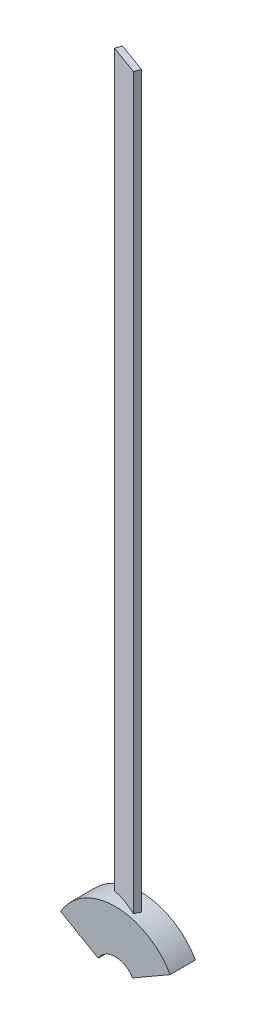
ISO-10303-21;
HEADER;
FILE_DESCRIPTION(('STEP AP214'),'2;1');
FILE_NAME('part.step','',(''),(''),'','','');
FILE_SCHEMA(('AUTOMOTIVE_DESIGN { 1 0 10303 214 1 1 1 1 }'));
ENDSEC;
DATA;
#1=APPLICATION_CONTEXT('core data for automotive mechanical design processes');
#2=APPLICATION_PROTOCOL_DEFINITION('international standard','automotive_design',2000,#1);
#3=PRODUCT_CONTEXT('',#1,'mechanical');
#4=PRODUCT('Part','Part','',(#3));
#5=PRODUCT_RELATED_PRODUCT_CATEGORY('part','',(#4));
#6=PRODUCT_DEFINITION_FORMATION('','',#4);
#7=PRODUCT_DEFINITION_CONTEXT('part definition',#1,'design');
#8=PRODUCT_DEFINITION('design','',#6,#7);
#9=PRODUCT_DEFINITION_SHAPE('','',#8);
#10=(LENGTH_UNIT() NAMED_UNIT(*) SI_UNIT(.MILLI.,.METRE.));
#11=(NAMED_UNIT(*) PLANE_ANGLE_UNIT() SI_UNIT($,.RADIAN.));
#12=(NAMED_UNIT(*) SI_UNIT($,.STERADIAN.) SOLID_ANGLE_UNIT());
#13=UNCERTAINTY_MEASURE_WITH_UNIT(LENGTH_MEASURE(1.E-05),#10,'distance_accuracy_value','');
#14=(GEOMETRIC_REPRESENTATION_CONTEXT(3) GLOBAL_UNCERTAINTY_ASSIGNED_CONTEXT((#13)) GLOBAL_UNIT_ASSIGNED_CONTEXT((#10,
#11,#12)) REPRESENTATION_CONTEXT('',''));
#15=CARTESIAN_POINT('',(0.,0.,0.));
#16=DIRECTION('',(0.,0.,1.));
#17=DIRECTION('',(1.,0.,0.));
#18=AXIS2_PLACEMENT_3D('',#15,#16,#17);
#19=CARTESIAN_POINT('',(0.,0.,80.));
#20=DIRECTION('',(0.,0.,-1.));
#21=DIRECTION('',(-1.,0.,0.));
#22=AXIS2_PLACEMENT_3D('',#19,#20,#21);
#23=CYLINDRICAL_SURFACE('',#22,400.);
#24=CARTESIAN_POINT('',(0.,0.,-292.380440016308));
#25=DIRECTION('',(0.939692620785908,0.,0.342020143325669));
#26=DIRECTION('',(0.342020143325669,0.,-0.939692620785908));
#27=AXIS2_PLACEMENT_3D('',#24,#25,#26);
#28=ELLIPSE('',#27,1169.52176006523,400.);
#29=CARTESIAN_POINT('',(-87.1288592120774,390.395391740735,-52.9958667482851));
#30=VERTEX_POINT('',#29);
#31=CARTESIAN_POINT('',(-100.809664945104,387.088376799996,-15.4081619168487));
#32=VERTEX_POINT('',#31);
#33=EDGE_CURVE('E117',#30,#32,#28,.T.);
#34=ORIENTED_EDGE('',*,*,#33,.F.);
#35=CARTESIAN_POINT('',(0.,0.,-21.2835554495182));
#36=DIRECTION('',(-0.342020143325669,0.,0.939692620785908));
#37=DIRECTION('',(-0.939692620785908,0.,-0.342020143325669));
#38=AXIS2_PLACEMENT_3D('',#35,#36,#37);
#39=ELLIPSE('',#38,425.671108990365,400.);
#40=CARTESIAN_POINT('',(100.809664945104,387.088376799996,15.4081619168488));
#41=VERTEX_POINT('',#40);
#42=EDGE_CURVE('E127',#41,#30,#39,.T.);
#43=ORIENTED_EDGE('',*,*,#42,.F.);
#44=CARTESIAN_POINT('',(0.,0.,292.380440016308));
#45=DIRECTION('',(-0.939692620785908,0.,-0.342020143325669));
#46=DIRECTION('',(0.342020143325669,0.,-0.939692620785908));
#47=AXIS2_PLACEMENT_3D('',#44,#45,#46);
#48=ELLIPSE('',#47,1169.52176006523,400.);
#49=CARTESIAN_POINT('',(87.1288592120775,390.395391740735,52.9958667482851));
#50=VERTEX_POINT('',#49);
#51=EDGE_CURVE('E124',#50,#41,#48,.T.);
#52=ORIENTED_EDGE('',*,*,#51,.F.);
#53=CARTESIAN_POINT('',(0.,0.,21.2835554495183));
#54=DIRECTION('',(0.342020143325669,0.,-0.939692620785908));
#55=DIRECTION('',(-0.939692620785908,0.,-0.342020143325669));
#56=AXIS2_PLACEMENT_3D('',#53,#54,#55);
#57=ELLIPSE('',#56,425.671108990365,400.);
#58=EDGE_CURVE('E119',#32,#50,#57,.T.);
#59=ORIENTED_EDGE('',*,*,#58,.F.);
#60=EDGE_LOOP('',(#34,#43,#52,#59));
#61=FACE_BOUND('',#60,.T.);
#62=DIRECTION('',(0.,0.,-1.));
#63=VECTOR('',#62,1.);
#64=CARTESIAN_POINT('',(346.410161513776,199.999999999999,80.));
#65=LINE('',#64,#63);
#66=CARTESIAN_POINT('',(346.410161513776,199.999999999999,-80.));
#67=VERTEX_POINT('',#66);
#68=CARTESIAN_POINT('',(346.410161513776,199.999999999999,80.));
#69=VERTEX_POINT('',#68);
#70=EDGE_CURVE('E106',#67,#69,#65,.F.);
#71=ORIENTED_EDGE('',*,*,#70,.F.);
#72=CARTESIAN_POINT('',(0.,0.,-80.));
#73=DIRECTION('',(0.,0.,1.));
#74=DIRECTION('',(1.,0.,0.));
#75=AXIS2_PLACEMENT_3D('',#72,#73,#74);
#76=CIRCLE('',#75,400.);
#77=CARTESIAN_POINT('',(-346.410161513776,199.999999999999,-80.));
#78=VERTEX_POINT('',#77);
#79=EDGE_CURVE('E131',#67,#78,#76,.T.);
#80=ORIENTED_EDGE('',*,*,#79,.T.);
#81=DIRECTION('',(0.,0.,-1.));
#82=VECTOR('',#81,1.);
#83=CARTESIAN_POINT('',(-346.410161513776,199.999999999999,80.));
#84=LINE('',#83,#82);
#85=CARTESIAN_POINT('',(-346.410161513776,199.999999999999,80.));
#86=VERTEX_POINT('',#85);
#87=EDGE_CURVE('E50',#86,#78,#84,.T.);
#88=ORIENTED_EDGE('',*,*,#87,.F.);
#89=CARTESIAN_POINT('',(0.,0.,80.));
#90=DIRECTION('',(0.,0.,1.));
#91=DIRECTION('',(1.,0.,0.));
#92=AXIS2_PLACEMENT_3D('',#89,#90,#91);
#93=CIRCLE('',#92,400.);
#94=EDGE_CURVE('E111',#69,#86,#93,.T.);
#95=ORIENTED_EDGE('',*,*,#94,.F.);
#96=EDGE_LOOP('',(#71,#80,#88,#95));
#97=FACE_BOUND('',#96,.T.);
#98=ADVANCED_FACE('F36',(#61,#97),#23,.T.);
#99=CARTESIAN_POINT('',(0.,0.,80.));
#100=DIRECTION('',(0.,0.,1.));
#101=DIRECTION('',(1.,0.,0.));
#102=AXIS2_PLACEMENT_3D('',#99,#100,#101);
#103=PLANE('',#102);
#104=CARTESIAN_POINT('',(0.,0.,80.));
#105=DIRECTION('',(0.,0.,1.));
#106=DIRECTION('',(1.,0.,0.));
#107=AXIS2_PLACEMENT_3D('',#104,#105,#106);
#108=CIRCLE('',#107,125.);
#109=CARTESIAN_POINT('',(108.253175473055,62.4999999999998,80.));
#110=VERTEX_POINT('',#109);
#111=CARTESIAN_POINT('',(-108.253175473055,62.4999999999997,80.));
#112=VERTEX_POINT('',#111);
#113=EDGE_CURVE('E100',#110,#112,#108,.T.);
#114=ORIENTED_EDGE('',*,*,#113,.F.);
#115=DIRECTION('',(0.86602540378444,0.499999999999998,0.));
#116=VECTOR('',#115,1.);
#117=CARTESIAN_POINT('',(0.,0.,80.));
#118=LINE('',#117,#116);
#119=EDGE_CURVE('E57',#110,#69,#118,.T.);
#120=ORIENTED_EDGE('',*,*,#119,.T.);
#121=ORIENTED_EDGE('',*,*,#94,.T.);
#122=DIRECTION('',(0.86602540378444,-0.499999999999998,0.));
#123=VECTOR('',#122,1.);
#124=CARTESIAN_POINT('',(0.,0.,80.));
#125=LINE('',#124,#123);
#126=EDGE_CURVE('E109',#86,#112,#125,.T.);
#127=ORIENTED_EDGE('',*,*,#126,.T.);
#128=EDGE_LOOP('',(#114,#120,#121,#127));
#129=FACE_BOUND('',#128,.T.);
#130=ADVANCED_FACE('F110',(#129),#103,.T.);
#131=CARTESIAN_POINT('',(0.,0.,-80.));
#132=DIRECTION('',(0.,0.,1.));
#133=DIRECTION('',(1.,0.,0.));
#134=AXIS2_PLACEMENT_3D('',#131,#132,#133);
#135=PLANE('',#134);
#136=DIRECTION('',(0.86602540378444,0.499999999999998,0.));
#137=VECTOR('',#136,1.);
#138=CARTESIAN_POINT('',(0.,0.,-80.));
#139=LINE('',#138,#137);
#140=CARTESIAN_POINT('',(108.253175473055,62.4999999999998,-80.));
#141=VERTEX_POINT('',#140);
#142=EDGE_CURVE('E158',#141,#67,#139,.T.);
#143=ORIENTED_EDGE('',*,*,#142,.F.);
#144=CARTESIAN_POINT('',(0.,0.,-80.));
#145=DIRECTION('',(0.,0.,1.));
#146=DIRECTION('',(1.,0.,0.));
#147=AXIS2_PLACEMENT_3D('',#144,#145,#146);
#148=CIRCLE('',#147,125.);
#149=CARTESIAN_POINT('',(-108.253175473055,62.4999999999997,-80.));
#150=VERTEX_POINT('',#149);
#151=EDGE_CURVE('E105',#141,#150,#148,.T.);
#152=ORIENTED_EDGE('',*,*,#151,.T.);
#153=DIRECTION('',(0.86602540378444,-0.499999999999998,0.));
#154=VECTOR('',#153,1.);
#155=CARTESIAN_POINT('',(0.,0.,-80.));
#156=LINE('',#155,#154);
#157=EDGE_CURVE('E113',#78,#150,#156,.T.);
#158=ORIENTED_EDGE('',*,*,#157,.F.);
#159=ORIENTED_EDGE('',*,*,#79,.F.);
#160=EDGE_LOOP('',(#143,#152,#158,#159));
#161=FACE_BOUND('',#160,.T.);
#162=ADVANCED_FACE('F167',(#161),#135,.F.);
#163=CARTESIAN_POINT('',(0.,0.,-80.));
#164=DIRECTION('',(0.,0.,1.));
#165=DIRECTION('',(1.,0.,0.));
#166=AXIS2_PLACEMENT_3D('',#163,#164,#165);
#167=CYLINDRICAL_SURFACE('',#166,125.);
#168=DIRECTION('',(0.,0.,1.));
#169=VECTOR('',#168,1.);
#170=CARTESIAN_POINT('',(108.253175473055,62.4999999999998,-80.));
#171=LINE('',#170,#169);
#172=EDGE_CURVE('E11',#110,#141,#171,.F.);
#173=ORIENTED_EDGE('',*,*,#172,.F.);
#174=ORIENTED_EDGE('',*,*,#113,.T.);
#175=DIRECTION('',(0.,0.,1.));
#176=VECTOR('',#175,1.);
#177=CARTESIAN_POINT('',(-108.253175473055,62.4999999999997,-80.));
#178=LINE('',#177,#176);
#179=EDGE_CURVE('E43',#150,#112,#178,.T.);
#180=ORIENTED_EDGE('',*,*,#179,.F.);
#181=ORIENTED_EDGE('',*,*,#151,.F.);
#182=EDGE_LOOP('',(#173,#174,#180,#181));
#183=FACE_BOUND('',#182,.T.);
#184=ADVANCED_FACE('F102',(#183),#167,.F.);
#185=CARTESIAN_POINT('',(-87.1288592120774,5000.,-52.9958667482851));
#186=DIRECTION('',(0.939692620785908,0.,0.342020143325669));
#187=DIRECTION('',(0.342020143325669,0.,-0.939692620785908));
#188=AXIS2_PLACEMENT_3D('',#185,#186,#187);
#189=PLANE('',#188);
#190=DIRECTION('',(0.,-1.,0.));
#191=VECTOR('',#190,1.);
#192=CARTESIAN_POINT('',(-87.1288592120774,5000.,-52.9958667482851));
#193=LINE('',#192,#191);
#194=CARTESIAN_POINT('',(-87.1288592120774,5000.,-52.9958667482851));
#195=VERTEX_POINT('',#194);
#196=EDGE_CURVE('E142',#195,#30,#193,.T.);
#197=ORIENTED_EDGE('',*,*,#196,.T.);
#198=ORIENTED_EDGE('',*,*,#33,.T.);
#199=DIRECTION('',(0.,-1.,0.));
#200=VECTOR('',#199,1.);
#201=CARTESIAN_POINT('',(-100.809664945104,5000.,-15.4081619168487));
#202=LINE('',#201,#200);
#203=CARTESIAN_POINT('',(-100.809664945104,5000.,-15.4081619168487));
#204=VERTEX_POINT('',#203);
#205=EDGE_CURVE('E133',#204,#32,#202,.T.);
#206=ORIENTED_EDGE('',*,*,#205,.F.);
#207=DIRECTION('',(-0.342020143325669,0.,0.939692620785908));
#208=VECTOR('',#207,1.);
#209=CARTESIAN_POINT('',(-87.1288592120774,5000.,-52.9958667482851));
#210=LINE('',#209,#208);
#211=EDGE_CURVE('E151',#195,#204,#210,.T.);
#212=ORIENTED_EDGE('',*,*,#211,.F.);
#213=EDGE_LOOP('',(#197,#198,#206,#212));
#214=FACE_BOUND('',#213,.T.);
#215=ADVANCED_FACE('F181',(#214),#189,.F.);
#216=CARTESIAN_POINT('',(-100.809664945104,5000.,-15.4081619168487));
#217=DIRECTION('',(0.342020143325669,0.,-0.939692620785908));
#218=DIRECTION('',(-0.939692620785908,0.,-0.342020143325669));
#219=AXIS2_PLACEMENT_3D('',#216,#217,#218);
#220=PLANE('',#219);
#221=ORIENTED_EDGE('',*,*,#205,.T.);
#222=ORIENTED_EDGE('',*,*,#58,.T.);
#223=DIRECTION('',(0.,-1.,0.));
#224=VECTOR('',#223,1.);
#225=CARTESIAN_POINT('',(87.1288592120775,5000.,52.9958667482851));
#226=LINE('',#225,#224);
#227=CARTESIAN_POINT('',(87.1288592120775,5000.,52.9958667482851));
#228=VERTEX_POINT('',#227);
#229=EDGE_CURVE('E136',#228,#50,#226,.T.);
#230=ORIENTED_EDGE('',*,*,#229,.F.);
#231=DIRECTION('',(0.939692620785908,0.,0.342020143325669));
#232=VECTOR('',#231,1.);
#233=CARTESIAN_POINT('',(-100.809664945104,5000.,-15.4081619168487));
#234=LINE('',#233,#232);
#235=EDGE_CURVE('E149',#204,#228,#234,.T.);
#236=ORIENTED_EDGE('',*,*,#235,.F.);
#237=EDGE_LOOP('',(#221,#222,#230,#236));
#238=FACE_BOUND('',#237,.T.);
#239=ADVANCED_FACE('F189',(#238),#220,.F.);
#240=CARTESIAN_POINT('',(87.1288592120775,5000.,52.9958667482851));
#241=DIRECTION('',(-0.939692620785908,0.,-0.342020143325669));
#242=DIRECTION('',(-0.342020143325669,0.,0.939692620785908));
#243=AXIS2_PLACEMENT_3D('',#240,#241,#242);
#244=PLANE('',#243);
#245=ORIENTED_EDGE('',*,*,#229,.T.);
#246=ORIENTED_EDGE('',*,*,#51,.T.);
#247=DIRECTION('',(0.,-1.,0.));
#248=VECTOR('',#247,1.);
#249=CARTESIAN_POINT('',(100.809664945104,5000.,15.4081619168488));
#250=LINE('',#249,#248);
#251=CARTESIAN_POINT('',(100.809664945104,5000.,15.4081619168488));
#252=VERTEX_POINT('',#251);
#253=EDGE_CURVE('E139',#252,#41,#250,.T.);
#254=ORIENTED_EDGE('',*,*,#253,.F.);
#255=DIRECTION('',(0.342020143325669,0.,-0.939692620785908));
#256=VECTOR('',#255,1.);
#257=CARTESIAN_POINT('',(87.1288592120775,5000.,52.9958667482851));
#258=LINE('',#257,#256);
#259=EDGE_CURVE('E147',#228,#252,#258,.T.);
#260=ORIENTED_EDGE('',*,*,#259,.F.);
#261=EDGE_LOOP('',(#245,#246,#254,#260));
#262=FACE_BOUND('',#261,.T.);
#263=ADVANCED_FACE('F187',(#262),#244,.F.);
#264=CARTESIAN_POINT('',(100.809664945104,5000.,15.4081619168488));
#265=DIRECTION('',(-0.342020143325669,0.,0.939692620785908));
#266=DIRECTION('',(0.939692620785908,0.,0.342020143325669));
#267=AXIS2_PLACEMENT_3D('',#264,#265,#266);
#268=PLANE('',#267);
#269=ORIENTED_EDGE('',*,*,#253,.T.);
#270=ORIENTED_EDGE('',*,*,#42,.T.);
#271=ORIENTED_EDGE('',*,*,#196,.F.);
#272=DIRECTION('',(-0.939692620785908,0.,-0.342020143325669));
#273=VECTOR('',#272,1.);
#274=CARTESIAN_POINT('',(100.809664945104,5000.,15.4081619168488));
#275=LINE('',#274,#273);
#276=EDGE_CURVE('E145',#252,#195,#275,.T.);
#277=ORIENTED_EDGE('',*,*,#276,.F.);
#278=EDGE_LOOP('',(#269,#270,#271,#277));
#279=FACE_BOUND('',#278,.T.);
#280=ADVANCED_FACE('F177',(#279),#268,.F.);
#281=CARTESIAN_POINT('',(-87.1288592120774,5000.,-52.9958667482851));
#282=DIRECTION('',(0.,-1.,0.));
#283=DIRECTION('',(0.,0.,-1.));
#284=AXIS2_PLACEMENT_3D('',#281,#282,#283);
#285=PLANE('',#284);
#286=ORIENTED_EDGE('',*,*,#211,.T.);
#287=ORIENTED_EDGE('',*,*,#235,.T.);
#288=ORIENTED_EDGE('',*,*,#259,.T.);
#289=ORIENTED_EDGE('',*,*,#276,.T.);
#290=EDGE_LOOP('',(#286,#287,#288,#289));
#291=FACE_BOUND('',#290,.T.);
#292=ADVANCED_FACE('F183',(#291),#285,.F.);
#293=CARTESIAN_POINT('',(0.,0.,14768.6278199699));
#294=DIRECTION('',(-0.499999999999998,-0.86602540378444,0.));
#295=DIRECTION('',(0.86602540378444,-0.499999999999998,0.));
#296=AXIS2_PLACEMENT_3D('',#293,#294,#295);
#297=PLANE('',#296);
#298=ORIENTED_EDGE('',*,*,#126,.F.);
#299=ORIENTED_EDGE('',*,*,#87,.T.);
#300=ORIENTED_EDGE('',*,*,#157,.T.);
#301=ORIENTED_EDGE('',*,*,#179,.T.);
#302=EDGE_LOOP('',(#298,#299,#300,#301));
#303=FACE_BOUND('',#302,.T.);
#304=ADVANCED_FACE('F116',(#303),#297,.T.);
#305=CARTESIAN_POINT('',(0.,0.,14768.6278199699));
#306=DIRECTION('',(0.499999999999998,-0.86602540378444,0.));
#307=DIRECTION('',(0.86602540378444,0.499999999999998,0.));
#308=AXIS2_PLACEMENT_3D('',#305,#306,#307);
#309=PLANE('',#308);
#310=ORIENTED_EDGE('',*,*,#142,.T.);
#311=ORIENTED_EDGE('',*,*,#70,.T.);
#312=ORIENTED_EDGE('',*,*,#119,.F.);
#313=ORIENTED_EDGE('',*,*,#172,.T.);
#314=EDGE_LOOP('',(#310,#311,#312,#313));
#315=FACE_BOUND('',#314,.T.);
#316=ADVANCED_FACE('F164',(#315),#309,.T.);
#317=CLOSED_SHELL('',(#98,#130,#162,#184,#215,#239,#263,#280,#292,#304,#316));
#318=MANIFOLD_SOLID_BREP('B2',#317);
#319=ADVANCED_BREP_SHAPE_REPRESENTATION('',(#18,#318),#14);
#320=SHAPE_DEFINITION_REPRESENTATION(#9,#319);
ENDSEC;
END-ISO-10303-21;
